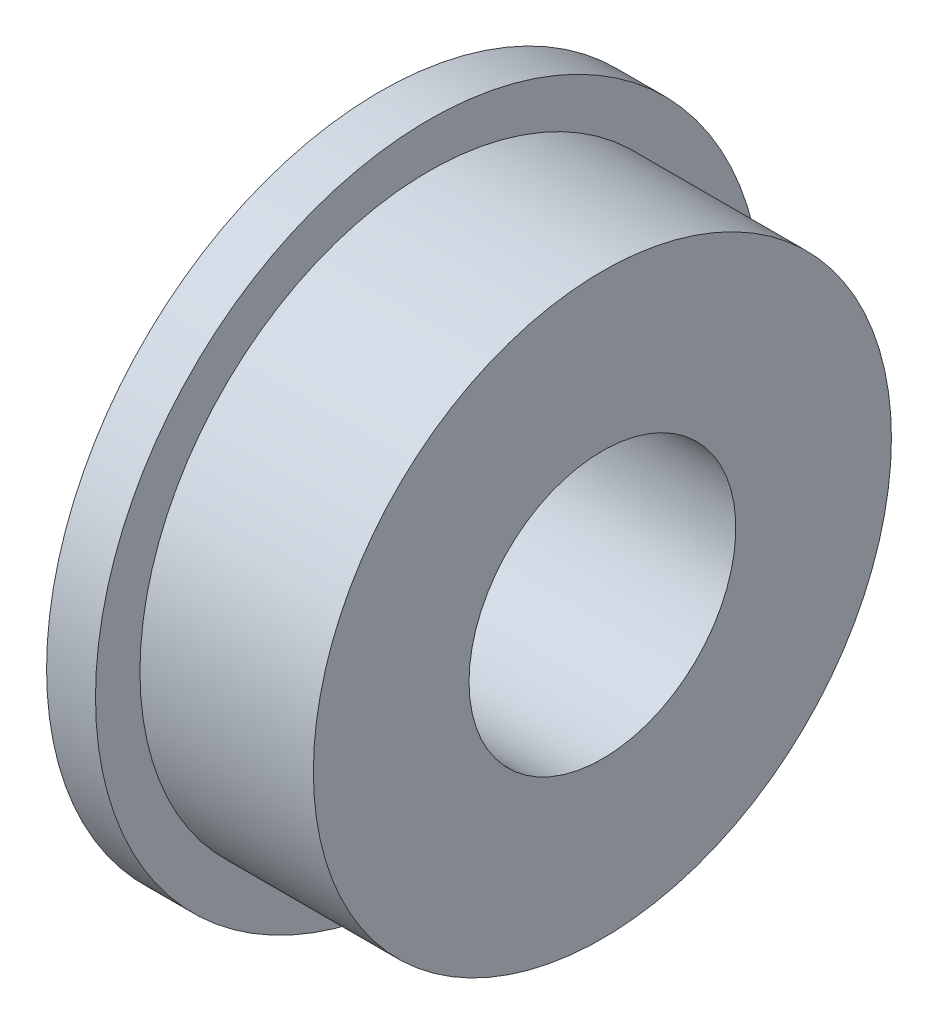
ISO-10303-21;
HEADER;
FILE_DESCRIPTION(('STEP AP214'),'2;1');
FILE_NAME('part.step','',(''),(''),'','','');
FILE_SCHEMA(('AUTOMOTIVE_DESIGN { 1 0 10303 214 1 1 1 1 }'));
ENDSEC;
DATA;
#1=APPLICATION_CONTEXT('core data for automotive mechanical design processes');
#2=APPLICATION_PROTOCOL_DEFINITION('international standard','automotive_design',2000,#1);
#3=PRODUCT_CONTEXT('',#1,'mechanical');
#4=PRODUCT('Part','Part','',(#3));
#5=PRODUCT_RELATED_PRODUCT_CATEGORY('part','',(#4));
#6=PRODUCT_DEFINITION_FORMATION('','',#4);
#7=PRODUCT_DEFINITION_CONTEXT('part definition',#1,'design');
#8=PRODUCT_DEFINITION('design','',#6,#7);
#9=PRODUCT_DEFINITION_SHAPE('','',#8);
#10=(LENGTH_UNIT() NAMED_UNIT(*) SI_UNIT(.MILLI.,.METRE.));
#11=(NAMED_UNIT(*) PLANE_ANGLE_UNIT() SI_UNIT($,.RADIAN.));
#12=(NAMED_UNIT(*) SI_UNIT($,.STERADIAN.) SOLID_ANGLE_UNIT());
#13=UNCERTAINTY_MEASURE_WITH_UNIT(LENGTH_MEASURE(1.E-05),#10,'distance_accuracy_value','');
#14=(GEOMETRIC_REPRESENTATION_CONTEXT(3) GLOBAL_UNCERTAINTY_ASSIGNED_CONTEXT((#13)) GLOBAL_UNIT_ASSIGNED_CONTEXT((#10,
#11,#12)) REPRESENTATION_CONTEXT('',''));
#15=CARTESIAN_POINT('',(0.,0.,0.));
#16=DIRECTION('',(0.,0.,1.));
#17=DIRECTION('',(1.,0.,0.));
#18=AXIS2_PLACEMENT_3D('',#15,#16,#17);
#19=CARTESIAN_POINT('',(0.,0.,0.));
#20=DIRECTION('',(-1.,0.,0.));
#21=DIRECTION('',(0.,0.,1.));
#22=AXIS2_PLACEMENT_3D('',#19,#20,#21);
#23=CYLINDRICAL_SURFACE('',#22,3.);
#24=CARTESIAN_POINT('',(5.,0.,0.));
#25=DIRECTION('',(-1.,0.,0.));
#26=DIRECTION('',(0.,0.,1.));
#27=AXIS2_PLACEMENT_3D('',#24,#25,#26);
#28=CIRCLE('',#27,3.);
#29=CARTESIAN_POINT('',(5.,0.,3.));
#30=VERTEX_POINT('',#29);
#31=EDGE_CURVE('E52',#30,#30,#28,.T.);
#32=ORIENTED_EDGE('',*,*,#31,.F.);
#33=EDGE_LOOP('',(#32));
#34=FACE_BOUND('',#33,.T.);
#35=CARTESIAN_POINT('',(0.,0.,0.));
#36=DIRECTION('',(-1.,0.,0.));
#37=DIRECTION('',(0.,0.,1.));
#38=AXIS2_PLACEMENT_3D('',#35,#36,#37);
#39=CIRCLE('',#38,3.);
#40=CARTESIAN_POINT('',(0.,0.,3.));
#41=VERTEX_POINT('',#40);
#42=EDGE_CURVE('E10',#41,#41,#39,.T.);
#43=ORIENTED_EDGE('',*,*,#42,.T.);
#44=EDGE_LOOP('',(#43));
#45=FACE_BOUND('',#44,.T.);
#46=ADVANCED_FACE('F30',(#34,#45),#23,.F.);
#47=CARTESIAN_POINT('',(0.,0.,-3.));
#48=DIRECTION('',(1.,0.,0.));
#49=DIRECTION('',(0.,0.,-1.));
#50=AXIS2_PLACEMENT_3D('',#47,#48,#49);
#51=PLANE('',#50);
#52=ORIENTED_EDGE('',*,*,#42,.F.);
#53=EDGE_LOOP('',(#52));
#54=FACE_BOUND('',#53,.T.);
#55=CARTESIAN_POINT('',(0.,0.,0.));
#56=DIRECTION('',(-1.,0.,0.));
#57=DIRECTION('',(0.,0.,1.));
#58=AXIS2_PLACEMENT_3D('',#55,#56,#57);
#59=CIRCLE('',#58,7.5);
#60=CARTESIAN_POINT('',(0.,0.,7.5));
#61=VERTEX_POINT('',#60);
#62=EDGE_CURVE('E36',#61,#61,#59,.T.);
#63=ORIENTED_EDGE('',*,*,#62,.T.);
#64=EDGE_LOOP('',(#63));
#65=FACE_BOUND('',#64,.T.);
#66=ADVANCED_FACE('F59',(#54,#65),#51,.F.);
#67=CARTESIAN_POINT('',(0.,0.,0.));
#68=DIRECTION('',(-1.,0.,0.));
#69=DIRECTION('',(0.,0.,1.));
#70=AXIS2_PLACEMENT_3D('',#67,#68,#69);
#71=CYLINDRICAL_SURFACE('',#70,7.5);
#72=ORIENTED_EDGE('',*,*,#62,.F.);
#73=EDGE_LOOP('',(#72));
#74=FACE_BOUND('',#73,.T.);
#75=CARTESIAN_POINT('',(1.1,0.,0.));
#76=DIRECTION('',(-1.,0.,0.));
#77=DIRECTION('',(0.,0.,1.));
#78=AXIS2_PLACEMENT_3D('',#75,#76,#77);
#79=CIRCLE('',#78,7.5);
#80=CARTESIAN_POINT('',(1.1,0.,7.5));
#81=VERTEX_POINT('',#80);
#82=EDGE_CURVE('E40',#81,#81,#79,.T.);
#83=ORIENTED_EDGE('',*,*,#82,.T.);
#84=EDGE_LOOP('',(#83));
#85=FACE_BOUND('',#84,.T.);
#86=ADVANCED_FACE('F63',(#74,#85),#71,.T.);
#87=CARTESIAN_POINT('',(1.1,0.,-7.5));
#88=DIRECTION('',(-1.,0.,0.));
#89=DIRECTION('',(0.,0.,1.));
#90=AXIS2_PLACEMENT_3D('',#87,#88,#89);
#91=PLANE('',#90);
#92=ORIENTED_EDGE('',*,*,#82,.F.);
#93=EDGE_LOOP('',(#92));
#94=FACE_BOUND('',#93,.T.);
#95=CARTESIAN_POINT('',(1.1,0.,0.));
#96=DIRECTION('',(-1.,0.,0.));
#97=DIRECTION('',(0.,0.,1.));
#98=AXIS2_PLACEMENT_3D('',#95,#96,#97);
#99=CIRCLE('',#98,6.5);
#100=CARTESIAN_POINT('',(1.1,0.,6.5));
#101=VERTEX_POINT('',#100);
#102=EDGE_CURVE('E44',#101,#101,#99,.T.);
#103=ORIENTED_EDGE('',*,*,#102,.T.);
#104=EDGE_LOOP('',(#103));
#105=FACE_BOUND('',#104,.T.);
#106=ADVANCED_FACE('F68',(#94,#105),#91,.F.);
#107=CARTESIAN_POINT('',(0.,0.,0.));
#108=DIRECTION('',(-1.,0.,0.));
#109=DIRECTION('',(0.,0.,1.));
#110=AXIS2_PLACEMENT_3D('',#107,#108,#109);
#111=CYLINDRICAL_SURFACE('',#110,6.5);
#112=ORIENTED_EDGE('',*,*,#102,.F.);
#113=EDGE_LOOP('',(#112));
#114=FACE_BOUND('',#113,.T.);
#115=CARTESIAN_POINT('',(5.,0.,0.));
#116=DIRECTION('',(-1.,0.,0.));
#117=DIRECTION('',(0.,0.,1.));
#118=AXIS2_PLACEMENT_3D('',#115,#116,#117);
#119=CIRCLE('',#118,6.5);
#120=CARTESIAN_POINT('',(5.,0.,6.5));
#121=VERTEX_POINT('',#120);
#122=EDGE_CURVE('E49',#121,#121,#119,.T.);
#123=ORIENTED_EDGE('',*,*,#122,.T.);
#124=EDGE_LOOP('',(#123));
#125=FACE_BOUND('',#124,.T.);
#126=ADVANCED_FACE('F74',(#114,#125),#111,.T.);
#127=CARTESIAN_POINT('',(5.,0.,-6.5));
#128=DIRECTION('',(-1.,0.,0.));
#129=DIRECTION('',(0.,0.,1.));
#130=AXIS2_PLACEMENT_3D('',#127,#128,#129);
#131=PLANE('',#130);
#132=ORIENTED_EDGE('',*,*,#122,.F.);
#133=EDGE_LOOP('',(#132));
#134=FACE_BOUND('',#133,.T.);
#135=ORIENTED_EDGE('',*,*,#31,.T.);
#136=EDGE_LOOP('',(#135));
#137=FACE_BOUND('',#136,.T.);
#138=ADVANCED_FACE('F56',(#134,#137),#131,.F.);
#139=CLOSED_SHELL('',(#46,#66,#86,#106,#126,#138));
#140=MANIFOLD_SOLID_BREP('B2',#139);
#141=ADVANCED_BREP_SHAPE_REPRESENTATION('',(#18,#140),#14);
#142=SHAPE_DEFINITION_REPRESENTATION(#9,#141);
ENDSEC;
END-ISO-10303-21;
